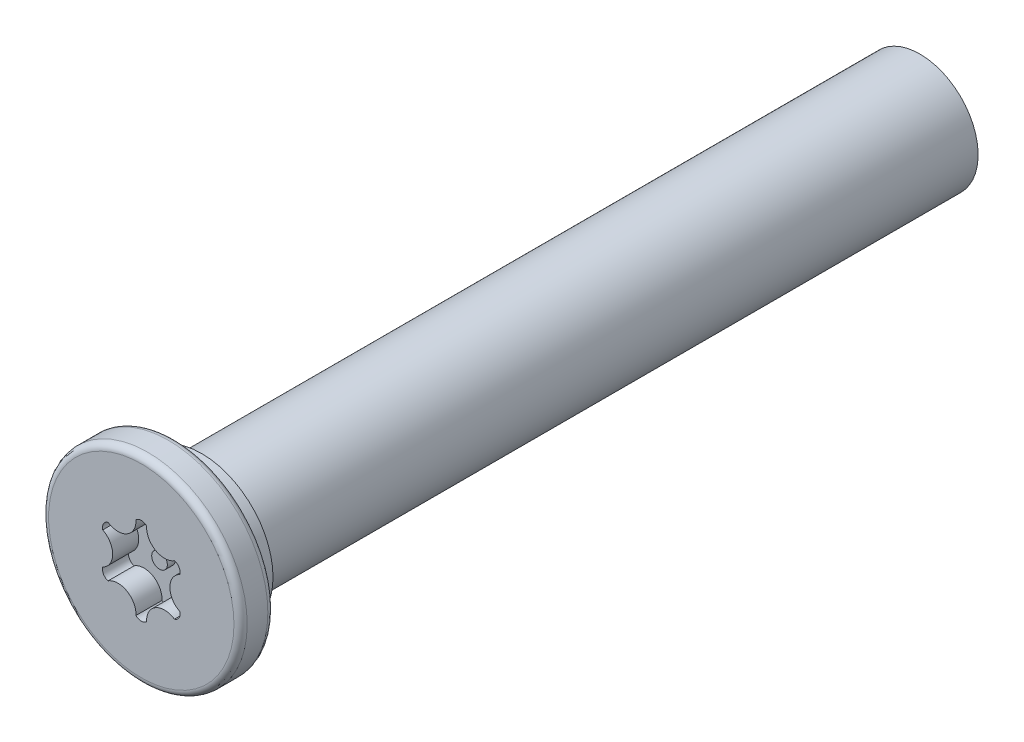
from build123d import *

# Parameters (mm, degrees)
SKETCH2_W           = 1.3
SKETCH2_H           = 3.81
SKETCH2_W_2         = 12.7
SKETCH2_H_2         = 2.23
CUT_EXTRUDE3_DEPTH  = 1
FILLET12_R          = 0.254
CUT_EXTRUDE6_START  = -12.7
SKETCH7_R           = 2.23
CUT_EXTRUDE6_DEPTH  = 12.7
SKETCH11_R          = 2.738000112
SKETCH11_R_2        = 2.230000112
BOSS_EXTRUDE1_DEPTH = 1.016
SKETCH12_R          = 2.230000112
BOSS_EXTRUDE2_DEPTH = 12.7
SKETCH14_R          = 0.3
BOSS_EXTRUDE4_DEPTH = 0.3
CUT_EXTRUDE7_START  = -12.7
SKETCH15_R          = 2.230000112
CUT_EXTRUDE7_DEPTH  = 12.7
SKETCH16_R          = 2.230000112
BOSS_EXTRUDE5_DEPTH = 28.575


with BuildPart() as part:
    # Sketch2 → Revolve1 (revolve)
    with BuildSketch(Plane(origin=(0, 0, 0), x_dir=(0, 0, -1), z_dir=(1, 0, 0)), mode=Mode.PRIVATE) as revolve1_sk:
        with Locations((0.65, 1.905)):
            Rectangle(SKETCH2_W, SKETCH2_H)
        with Locations((7.65, 1.115)):
            Rectangle(SKETCH2_W_2, SKETCH2_H_2)
    revolve(revolve1_sk.sketch.rotate(Axis((0, 0, -1.3), (0, 0, -1)), 90), axis=Axis((0, 0, -1.3), (0, 0, -1)))

    # Sketch3 → Cut-Extrude3 (cut)
    with BuildSketch(Plane.XY):
        with BuildLine():
            ThreePointArc((-0.205060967, 1.589373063), (0, 1.674312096), (0.205060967, 1.589373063))
            ThreePointArc((0.205060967, 1.589373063), (0.54882888, 0.950599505), (1.273906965, 0.972274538))
            ThreePointArc((1.273906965, 0.972274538), (1.449996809, 0.837156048), (1.478967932, 0.617098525))
            ThreePointArc((1.478967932, 0.617098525), (1.097657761, 0), (1.478967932, -0.617098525))
            ThreePointArc((1.478967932, -0.617098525), (1.449996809, -0.837156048), (1.273906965, -0.972274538))
            ThreePointArc((1.273906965, -0.972274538), (0.54882888, -0.950599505), (0.205060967, -1.589373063))
            ThreePointArc((0.205060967, -1.589373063), (0, -1.674312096), (-0.205060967, -1.589373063))
            ThreePointArc((-0.205060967, -1.589373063), (-0.54882888, -0.950599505), (-1.273906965, -0.972274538))
            ThreePointArc((-1.273906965, -0.972274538), (-1.449996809, -0.837156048), (-1.478967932, -0.617098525))
            ThreePointArc((-1.478967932, -0.617098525), (-1.097657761, 0), (-1.478967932, 0.617098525))
            ThreePointArc((-1.478967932, 0.617098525), (-1.449996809, 0.837156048), (-1.273906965, 0.972274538))
            ThreePointArc((-1.273906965, 0.972274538), (-0.54882888, 0.950599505), (-0.205060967, 1.589373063))
        make_face()
    extrude(amount=-CUT_EXTRUDE3_DEPTH, mode=Mode.SUBTRACT)

    # Fillet12
    fillet12_edges = [part.edges().sort_by_distance(p)[0] for p in [
        (-3.81, 0, 0),
        (-3.81, 0, -1.3),
    ]]
    fillet(fillet12_edges, radius=FILLET12_R)

    # Sketch7 → Cut-Extrude6 (cut)
    with BuildSketch(Plane(origin=(0, 0, -14), x_dir=(-1, 0, 0), z_dir=(0, 0, -1)).offset(CUT_EXTRUDE6_START)):
        Circle(SKETCH7_R)
    extrude(amount=CUT_EXTRUDE6_DEPTH, mode=Mode.SUBTRACT)

    # Sketch11 → Boss-Extrude1 (add)
    with BuildSketch(Plane(origin=(0, 0, -1.3), x_dir=(-1, 0, 0), z_dir=(0, 0, -1))):
        with Locations(Location((0, 0, 0), (0, 0, 180))):
            Circle(SKETCH11_R)
        Circle(SKETCH11_R_2, mode=Mode.SUBTRACT)
    extrude(amount=BOSS_EXTRUDE1_DEPTH)

    # Sketch12 → Boss-Extrude2 (add)
    with BuildSketch(Plane(origin=(0, 0, -1.3), x_dir=(-1, 0, 0), z_dir=(0, 0, -1))):
        Circle(SKETCH12_R)
    extrude(amount=BOSS_EXTRUDE2_DEPTH)

    # Sketch14 → Boss-Extrude4 (add)
    with BuildSketch(Plane.XY.offset(-1)):
        Circle(SKETCH14_R)
    extrude(amount=BOSS_EXTRUDE4_DEPTH)

    # Sketch15 → Cut-Extrude7 (cut)
    with BuildSketch(Plane(origin=(0, 0, -14), x_dir=(-1, 0, 0), z_dir=(0, 0, -1)).offset(CUT_EXTRUDE7_START)):
        Circle(SKETCH15_R)
    extrude(amount=CUT_EXTRUDE7_DEPTH, mode=Mode.SUBTRACT)

    # Sketch16 → Boss-Extrude5 (add)
    with BuildSketch(Plane(origin=(0, 0, -1.3), x_dir=(-1, 0, 0), z_dir=(0, 0, -1))):
        Circle(SKETCH16_R)
    extrude(amount=BOSS_EXTRUDE5_DEPTH)


solid = part.part
